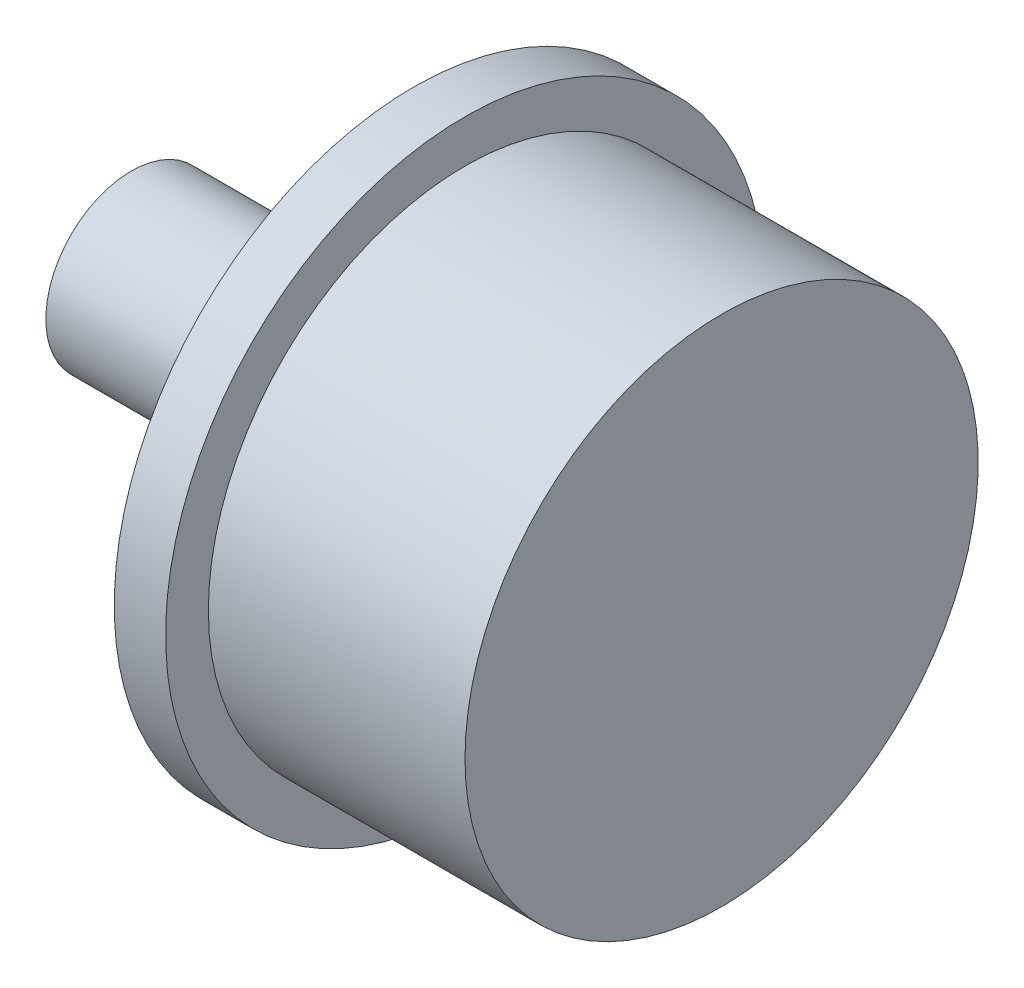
from build123d import *

# Parameters (mm, degrees)
SKETCH1_R      = 22.225
EXTRUDE1_DEPTH = 3.81
SKETCH2_R      = 19.05
EXTRUDE2_DEPTH = 19.05
SKETCH3_R      = 7.62
EXTRUDE3_DEPTH = 1.905
SKETCH4_R      = 6.35
EXTRUDE4_DEPTH = 19.05


with BuildPart() as part:
    # Sketch1 → Extrude1 (new body)
    with BuildSketch(Plane(origin=(0, 0, 0), x_dir=(0, 0, -1), z_dir=(1, 0, 0))):
        Circle(SKETCH1_R)
    extrude(amount=-EXTRUDE1_DEPTH)

    # Sketch2 → Extrude2 (add)
    with BuildSketch(Plane(origin=(0, 0, 0), x_dir=(0, 0, -1), z_dir=(1, 0, 0))):
        with Locations(Location((0, 0, 0), (0, 0, 180))):
            Circle(SKETCH2_R)
    extrude(amount=EXTRUDE2_DEPTH)

    # Sketch3 → Extrude3 (add)
    with BuildSketch(Plane.ZY.offset(3.81)):
        with Locations(Location((0, 0, 0), (0, 0, 180))):
            Circle(SKETCH3_R)
    extrude(amount=EXTRUDE3_DEPTH)

    # Sketch4 → Extrude4 (add)
    with BuildSketch(Plane.ZY.offset(5.715)):
        with Locations(Location((0, 0, 0), (0, 0, 180))):
            Circle(SKETCH4_R)
    extrude(amount=EXTRUDE4_DEPTH)


solid = part.part
